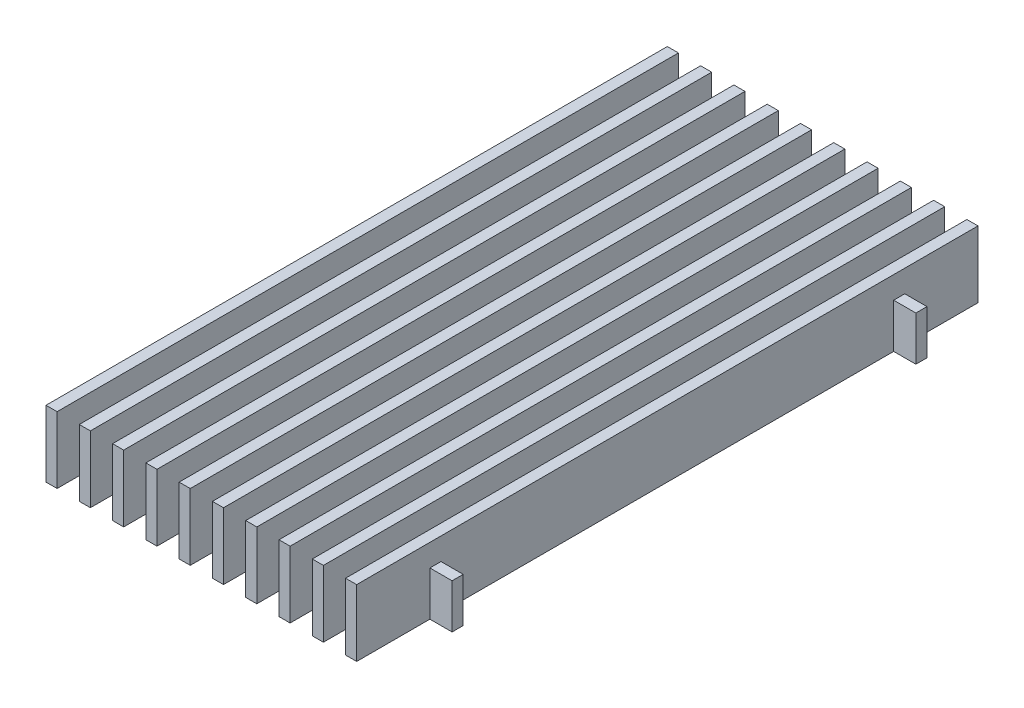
from build123d import *

# Parameters (mm, degrees)
SKETCH1_W           = 3.175
SKETCH1_H           = 19.05
BOSS_EXTRUDE1_DEPTH = 177.8
LPATTERN1_COUNT     = 10
LPATTERN1_PITCH     = 9.525
SKETCH2_W           = 3.175
SKETCH2_H           = 12.7
BOSS_EXTRUDE2_DEPTH = 50.8


with BuildPart() as part:
    # Sketch1 → Boss-Extrude1 (new body)
    with BuildSketch(Plane.XY):
        Rectangle(SKETCH1_W, SKETCH1_H)
    extrude(amount=-BOSS_EXTRUDE1_DEPTH)


with BuildPart() as lpattern1_1:
    # LPattern1: pattern copy
    add(part.part.moved(Location(Vector(1, 0, 0) * (1 * LPATTERN1_PITCH))))


with BuildPart() as lpattern1_2:
    # LPattern1: pattern copy
    add(part.part.moved(Location(Vector(1, 0, 0) * (2 * LPATTERN1_PITCH))))


with BuildPart() as lpattern1_3:
    # LPattern1: pattern copy
    add(part.part.moved(Location(Vector(1, 0, 0) * (3 * LPATTERN1_PITCH))))


with BuildPart() as lpattern1_4:
    # LPattern1: pattern copy
    add(part.part.moved(Location(Vector(1, 0, 0) * (4 * LPATTERN1_PITCH))))


with BuildPart() as lpattern1_5:
    # LPattern1: pattern copy
    add(part.part.moved(Location(Vector(1, 0, 0) * (5 * LPATTERN1_PITCH))))


with BuildPart() as lpattern1_6:
    # LPattern1: pattern copy
    add(part.part.moved(Location(Vector(1, 0, 0) * (6 * LPATTERN1_PITCH))))


with BuildPart() as lpattern1_7:
    # LPattern1: pattern copy
    add(part.part.moved(Location(Vector(1, 0, 0) * (7 * LPATTERN1_PITCH))))


with BuildPart() as lpattern1_8:
    # LPattern1: pattern copy
    add(part.part.moved(Location(Vector(1, 0, 0) * (8 * LPATTERN1_PITCH))))


with BuildPart() as lpattern1_9:
    # LPattern1: pattern copy
    add(part.part.moved(Location(Vector(1, 0, 0) * (9 * LPATTERN1_PITCH))))


with BuildPart() as part_1:
    add(part.part)

    add(lpattern1_1.part)  # Boss-Extrude2 merges LPattern1_1

    add(lpattern1_2.part)  # Boss-Extrude2 merges LPattern1_2

    add(lpattern1_3.part)  # Boss-Extrude2 merges LPattern1_3

    add(lpattern1_4.part)  # Boss-Extrude2 merges LPattern1_4

    add(lpattern1_5.part)  # Boss-Extrude2 merges LPattern1_5

    add(lpattern1_6.part)  # Boss-Extrude2 merges LPattern1_6

    add(lpattern1_7.part)  # Boss-Extrude2 merges LPattern1_7

    add(lpattern1_8.part)  # Boss-Extrude2 merges LPattern1_8

    add(lpattern1_9.part)  # Boss-Extrude2 merges LPattern1_9
    # Sketch2 → Boss-Extrude2 (add, symmetric)
    with BuildSketch(Plane.ZY.offset(-42.8625)):
        with Locations((-155.2575, -3.175)):
            Rectangle(SKETCH2_W, SKETCH2_H)
        with Locations((-22.5425, -3.175)):
            Rectangle(SKETCH2_W, SKETCH2_H)
    extrude(amount=BOSS_EXTRUDE2_DEPTH, both=True)


solid = part_1.part
